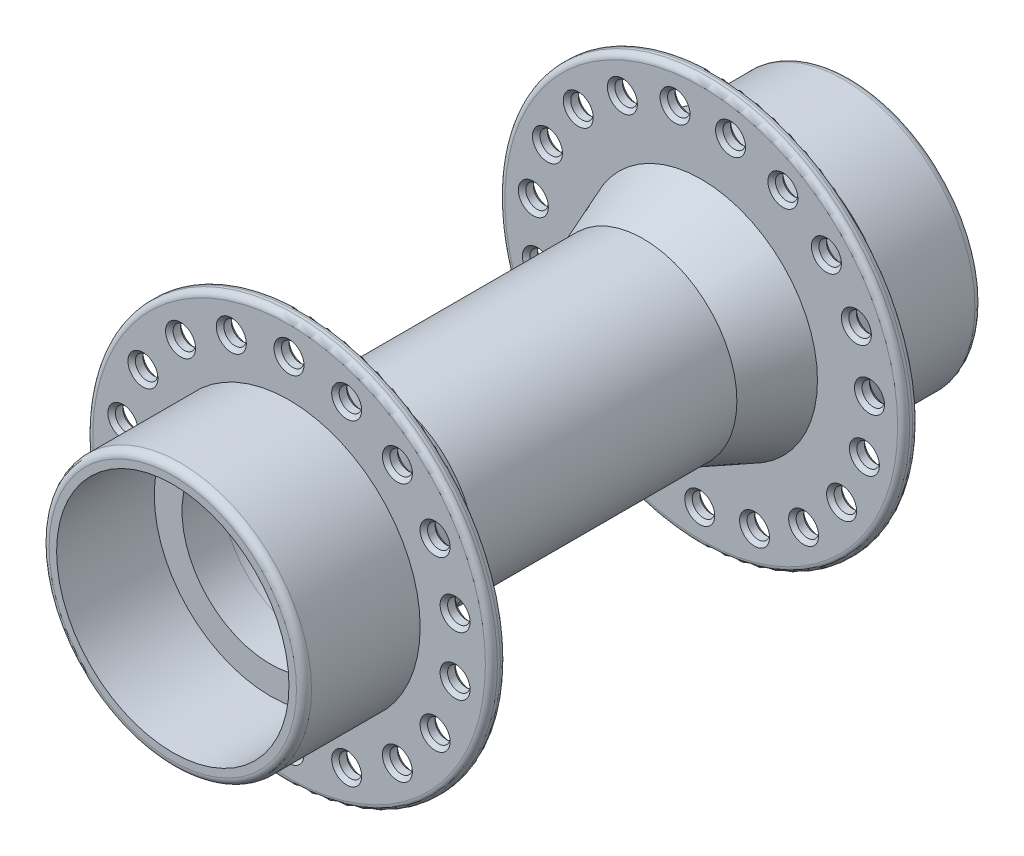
from build123d import *

# Parameters (mm, degrees)
SKETCH2_R                    = 1.5
EXTRUDE1_DEPTH               = 60.207790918
CHAMFER1_SIZE                = 0.5
CIRPATTERN1_COUNT            = 18
CHAMFER1_OF_CIRPATTERN1_SIZE = 0.5
SKETCH3_R                    = 1.5
EXTRUDE2_DEPTH               = 60.207790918
CHAMFER2_SIZE                = 0.5
CIRPATTERN2_COUNT            = 19
CHAMFER2_OF_CIRPATTERN2_SIZE = 0.5


with BuildPart() as part:
    # Sketch1 → Revolve1 (revolve)
    with BuildSketch(Plane(origin=(0, 0, 0), x_dir=(0, 0, -1), z_dir=(1, 0, 0)), mode=Mode.PRIVATE) as revolve1_sk:
        with BuildLine():
            Line((44.25, 17.5), (33.25, 17.5))
            Line((33.25, 17.5), (33.25, 18))
            Line((33.25, 18), (27.25, 18))
            Line((27.25, 18), (27.25, 26.2))
            ThreePointArc((27.25, 26.2), (27.015685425, 26.765685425), (26.45, 27))
            Line((26.45, 27), (26.05, 27))
            ThreePointArc((26.05, 27), (25.484314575, 26.765685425), (25.25, 26.2))
            Line((25.25, 26.2), (25.25, 15.5))
            Line((25.25, 15.5), (17.5, 12.5))
            Line((17.5, 12.5), (-17.5, 12.5))
            Line((-17.5, 12.5), (-27.75, 15.5))
            Line((-27.75, 15.5), (-27.75, 26.2))
            ThreePointArc((-27.75, 26.2), (-27.984314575, 26.765685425), (-28.55, 27))
            Line((-28.55, 27), (-28.95, 27))
            ThreePointArc((-28.95, 27), (-29.515685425, 26.765685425), (-29.75, 26.2))
            Line((-29.75, 26.2), (-29.75, 17.5))
            Line((-29.75, 17.5), (-44.25, 17.5))
            ThreePointArc((-44.25, 17.5), (-44.957106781, 17.207106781), (-45.25, 16.5))
            Line((-45.25, 16.5), (-45.25, 15.5))
            Line((-45.25, 15.5), (-32.220949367, 15.5))
            Line((-32.220949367, 15.5), (-32.220949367, 11.798899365))
            Line((-32.220949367, 11.798899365), (-26.964011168, 11.798899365))
            ThreePointArc((-26.964011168, 11.798899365), (-23.111084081, 10.932468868), (-20, 8.5))
            Line((-20, 8.5), (20, 8.5))
            ThreePointArc((20, 8.5), (23.258604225, 11.53668045), (27.574278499, 12.638898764))
            Line((27.574278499, 12.638898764), (29.509947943, 12.638898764))
            Line((29.509947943, 12.638898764), (29.509947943, 15.077171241))
            Line((29.509947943, 15.077171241), (45.25, 15.077171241))
            Line((45.25, 15.077171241), (45.25, 16.5))
            ThreePointArc((45.25, 16.5), (44.957106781, 17.207106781), (44.25, 17.5))
        make_face()
    revolve(revolve1_sk.sketch.rotate(Axis((0, 0, 45.25), (0, 0, -1)), 90), axis=Axis((0, 0, 45.25), (0, 0, -1)))

    # Sketch2 → Extrude1 (cut, through all)
    with BuildSketch(Plane.XY):
        with Locations(Location((0, 22.5, 0), (0, 0, 180))):
            Circle(SKETCH2_R)
    extrude1 = extrude(amount=EXTRUDE1_DEPTH, mode=Mode.SUBTRACT)

    # Chamfer1
    chamfer1_edges = [part.edges().sort_by_distance(p)[0] for p in [
        (1.5, 22.5, 29.75),
        (1.5, 22.5, 27.75),
    ]]
    chamfer(chamfer1_edges, length=CHAMFER1_SIZE)

    # CirPattern1: Extrude1 ×18 about axis
    cirpattern1_axis = Axis((0, 0, 0), (0, 0, 1))
    for i in range(1, CIRPATTERN1_COUNT):
        add(extrude1.rotate(cirpattern1_axis, i * 360 / CIRPATTERN1_COUNT), mode=Mode.SUBTRACT)

    # Chamfer1 of CirPattern1
    chamfer1_of_cirpattern1_edges = [part.edges().sort_by_distance(p)[0] for p in [
        (-6.285914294, 21.656114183, 29.75),
        (-6.285914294, 21.656114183, 27.75),
        (-13.313654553, 18.200181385, 29.75),
        (-13.313654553, 18.200181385, 27.75),
        (-18.735571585, 12.549038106, 29.75),
        (-18.735571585, 12.549038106, 27.75),
        (-21.897702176, 5.384295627, 29.75),
        (-21.897702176, 5.384295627, 27.75),
        (-22.418646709, -2.429872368, 29.75),
        (-22.418646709, -2.429872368, 27.75),
        (-20.235571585, -9.950961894, 29.75),
        (-20.235571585, -9.950961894, 27.75),
        (-15.611787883, -16.271818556, 29.75),
        (-15.611787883, -16.271818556, 27.75),
        (-9.104992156, -20.630053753, 29.75),
        (-9.104992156, -20.630053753, 27.75),
        (-1.5, -22.5, 29.75),
        (-1.5, -22.5, 27.75),
        (6.285914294, -21.656114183, 29.75),
        (6.285914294, -21.656114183, 27.75),
        (13.313654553, -18.200181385, 29.75),
        (13.313654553, -18.200181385, 27.75),
        (18.735571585, -12.549038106, 29.75),
        (18.735571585, -12.549038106, 27.75),
        (21.897702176, -5.384295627, 29.75),
        (21.897702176, -5.384295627, 27.75),
        (22.418646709, 2.429872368, 29.75),
        (22.418646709, 2.429872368, 27.75),
        (20.235571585, 9.950961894, 29.75),
        (20.235571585, 9.950961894, 27.75),
        (15.611787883, 16.271818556, 29.75),
        (15.611787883, 16.271818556, 27.75),
        (9.104992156, 20.630053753, 29.75),
        (9.104992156, 20.630053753, 27.75),
    ]]
    chamfer(chamfer1_of_cirpattern1_edges, length=CHAMFER1_OF_CIRPATTERN1_SIZE)

    # Sketch3 → Extrude2 (cut, through all)
    with BuildSketch(Plane.XY):
        with Locations((3.907083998, 22.158174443)):
            Circle(SKETCH3_R)
    extrude2 = extrude(amount=-EXTRUDE2_DEPTH, mode=Mode.SUBTRACT)

    # Chamfer2
    chamfer2_edges = [part.edges().sort_by_distance(p)[0] for p in [
        (2.407083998, 22.158174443, -27.25),
        (2.407083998, 22.158174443, -25.25),
    ]]
    chamfer(chamfer2_edges, length=CHAMFER2_SIZE)

    # CirPattern2: Extrude2 ×19 about axis
    cirpattern2_axis = Axis((0, 0, 0), (0, 0, 1))
    for i in range(1, CIRPATTERN2_COUNT):
        add(extrude2.rotate(cirpattern2_axis, i * 360 / CIRPATTERN2_COUNT), mode=Mode.SUBTRACT)

    # Chamfer2 of CirPattern2
    chamfer2_of_cirpattern2_edges = [part.edges().sort_by_distance(p)[0] for p in [
        (-4.918085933, 21.739162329, -27.25),
        (-4.918085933, 21.739162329, -25.25),
        (-11.710304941, 18.964374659, -27.25),
        (-11.710304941, 18.964374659, -25.25),
        (-17.233530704, 14.134502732, -27.25),
        (-17.233530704, 14.134502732, -25.25),
        (-20.88923601, 7.772938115, -27.25),
        (-20.88923601, 7.772938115, -25.25),
        (-22.281268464, 0.569055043, -27.25),
        (-22.281268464, 0.569055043, -25.25),
        (-21.258779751, -6.696493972, -27.25),
        (-21.258779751, -6.696493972, -25.25),
        (-17.932572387, -13.236373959, -27.25),
        (-17.932572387, -13.236373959, -25.25),
        (-12.663092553, -18.341887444, -27.25),
        (-12.663092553, -18.341887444, -25.25),
        (-6.021370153, -21.45977282, -27.25),
        (-6.021370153, -21.45977282, -25.25),
        (1.272861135, -22.252158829, -27.25),
        (1.272861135, -22.252158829, -25.25),
        (8.429158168, -20.633178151, -27.25),
        (8.429158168, -20.633178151, -25.25),
        (14.672025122, -16.778272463, -27.25),
        (14.672025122, -16.778272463, -25.25),
        (19.324950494, -11.105180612, -27.25),
        (19.324950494, -11.105180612, -25.25),
        (21.883717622, -4.228670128, -27.25),
        (21.883717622, -4.228670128, -25.25),
        (22.071044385, 3.10608238, -27.25),
        (22.071044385, 3.10608238, -25.25),
        (19.866631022, 10.104242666, -27.25),
        (19.866631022, 10.104242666, -25.25),
        (15.509359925, 16.007451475, -27.25),
        (15.509359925, 16.007451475, -25.25),
        (9.471409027, 20.176004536, -27.25),
        (9.471409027, 20.176004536, -25.25),
    ]]
    chamfer(chamfer2_of_cirpattern2_edges, length=CHAMFER2_OF_CIRPATTERN2_SIZE)


solid = part.part
